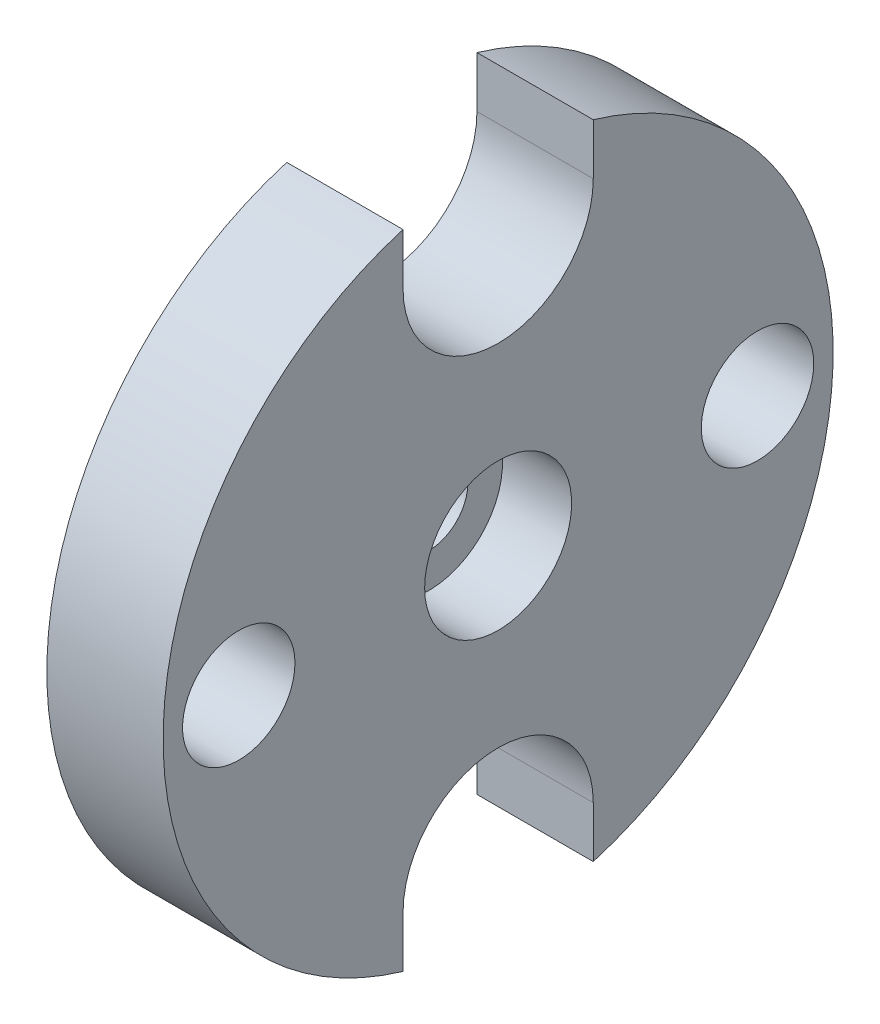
from build123d import *

# Parameters (mm, degrees)
SKIZZE1_W                          = 2.69
SKIZZE1_H                          = 7.75
F_0_34_0_35_DURCHMESSER_BOHRUNG1_D = 0.3
F_2_6_2_6_DURCHMESSER_BOHRUNG1_D   = 2.6
LINEAR_AUSTRAGEN1_DEPTH            = 12.285437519


with BuildPart() as part:
    # Skizze1 → Rotation1 (revolve)
    with BuildSketch(Plane.XY, mode=Mode.PRIVATE) as rotation1_sk:
        with Locations((1.345, 3.875)):
            Rectangle(SKIZZE1_W, SKIZZE1_H)
    revolve(rotation1_sk.sketch.rotate(Axis((0, 0, 0), (1, 0, 0)), 90), axis=Axis((0, 0, 0), (1, 0, 0)))

    # Skizze2 → Schnitt-Rotation1 (revolve, cut)
    with BuildSketch(Plane.XY, mode=Mode.PRIVATE) as schnitt_rotation1_sk:
        Polygon((2.69, 1.7), (1.09, 1.7), (1.09, 0.9), (0.29, 0.9), (0.29, 0), (2.69, 0), align=None)
    revolve(schnitt_rotation1_sk.sketch.rotate(Axis((0, 0, 0), (1, 0, 0)), 90), axis=Axis((0, 0, 0), (1, 0, 0)), mode=Mode.SUBTRACT)

    # 0.34 _0.35_ Durchmesser Bohrung1 (through all)
    with Locations(Plane(origin=(0.29, 0, 0), x_dir=(0, 0, -1), z_dir=(1, 0, 0))):
        with Locations((0, 0.28), (0, -0.28)):
            Hole(F_0_34_0_35_DURCHMESSER_BOHRUNG1_D / 2)

    # 2.6 _2.6_ Durchmesser Bohrung1 (through all)
    with Locations(Plane(origin=(2.69, 3.726930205, 0.447060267), x_dir=(0, 0, -1), z_dir=(1, 0, 0))):
        with Locations((6.447060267, -3.726930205), (-5.552939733, -3.726930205)):
            Hole(F_2_6_2_6_DURCHMESSER_BOHRUNG1_D / 2)

    # Skizze8 → Linear austragen1 (cut, through all)
    with BuildSketch(Plane(origin=(2.69, 0, 0), x_dir=(0, 0, -1), z_dir=(1, 0, 0))):
        with BuildLine():
            Line((-2.2, 7.75), (2.2, 7.75))
            Line((2.2, 7.75), (2.2, 6.25))
            ThreePointArc((2.2, 6.25), (0, 4.05), (-2.2, 6.25))
            Line((-2.2, 6.25), (-2.2, 7.75))
        make_face()
        with BuildLine():
            Line((2.2, -7.75), (2.2, -6.25))
            ThreePointArc((2.2, -6.25), (0, -4.05), (-2.2, -6.25))
            Line((-2.2, -6.25), (-2.2, -7.75))
            Line((-2.2, -7.75), (2.2, -7.75))
        make_face()
    extrude(amount=-LINEAR_AUSTRAGEN1_DEPTH, mode=Mode.SUBTRACT)


solid = part.part
